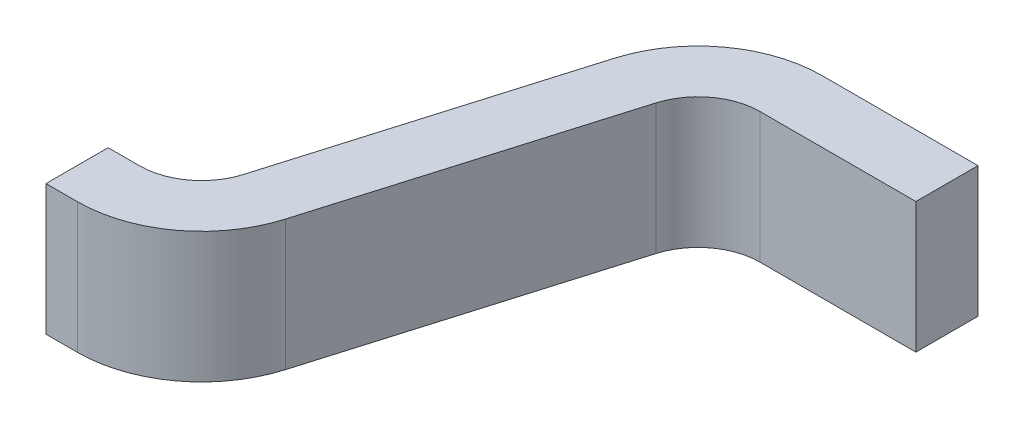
ISO-10303-21;
HEADER;
FILE_DESCRIPTION(('STEP AP214'),'2;1');
FILE_NAME('part.step','',(''),(''),'','','');
FILE_SCHEMA(('AUTOMOTIVE_DESIGN { 1 0 10303 214 1 1 1 1 }'));
ENDSEC;
DATA;
#1=APPLICATION_CONTEXT('core data for automotive mechanical design processes');
#2=APPLICATION_PROTOCOL_DEFINITION('international standard','automotive_design',2000,#1);
#3=PRODUCT_CONTEXT('',#1,'mechanical');
#4=PRODUCT('Part','Part','',(#3));
#5=PRODUCT_RELATED_PRODUCT_CATEGORY('part','',(#4));
#6=PRODUCT_DEFINITION_FORMATION('','',#4);
#7=PRODUCT_DEFINITION_CONTEXT('part definition',#1,'design');
#8=PRODUCT_DEFINITION('design','',#6,#7);
#9=PRODUCT_DEFINITION_SHAPE('','',#8);
#10=(LENGTH_UNIT() NAMED_UNIT(*) SI_UNIT(.MILLI.,.METRE.));
#11=(NAMED_UNIT(*) PLANE_ANGLE_UNIT() SI_UNIT($,.RADIAN.));
#12=(NAMED_UNIT(*) SI_UNIT($,.STERADIAN.) SOLID_ANGLE_UNIT());
#13=UNCERTAINTY_MEASURE_WITH_UNIT(LENGTH_MEASURE(1.E-05),#10,'distance_accuracy_value','');
#14=(GEOMETRIC_REPRESENTATION_CONTEXT(3) GLOBAL_UNCERTAINTY_ASSIGNED_CONTEXT((#13)) GLOBAL_UNIT_ASSIGNED_CONTEXT((#10,
#11,#12)) REPRESENTATION_CONTEXT('',''));
#15=CARTESIAN_POINT('',(0.,0.,0.));
#16=DIRECTION('',(0.,0.,1.));
#17=DIRECTION('',(1.,0.,0.));
#18=AXIS2_PLACEMENT_3D('',#15,#16,#17);
#19=CARTESIAN_POINT('',(4.4000000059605,-1.6950000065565,0.));
#20=DIRECTION('',(0.,-1.,0.));
#21=DIRECTION('',(1.,0.,0.));
#22=AXIS2_PLACEMENT_3D('',#19,#20,#21);
#23=PLANE('',#22);
#24=CARTESIAN_POINT('',(4.69869430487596,-1.6950000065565,0.40000000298));
#25=DIRECTION('',(0.,1.,0.));
#26=DIRECTION('',(-1.,0.,0.));
#27=AXIS2_PLACEMENT_3D('',#24,#25,#26);
#28=CIRCLE('',#27,0.2);
#29=CARTESIAN_POINT('',(4.50693033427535,-1.6950000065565,0.343197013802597));
#30=VERTEX_POINT('',#29);
#31=CARTESIAN_POINT('',(4.69869430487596,-1.6950000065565,0.20000000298));
#32=VERTEX_POINT('',#31);
#33=EDGE_CURVE('E189',#30,#32,#28,.F.);
#34=ORIENTED_EDGE('',*,*,#33,.T.);
#35=DIRECTION('',(1.,0.,0.));
#36=VECTOR('',#35,1.);
#37=CARTESIAN_POINT('',(5.2000000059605,-1.6950000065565,0.20000000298));
#38=LINE('',#37,#36);
#39=CARTESIAN_POINT('',(5.2000000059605,-1.6950000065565,0.20000000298));
#40=VERTEX_POINT('',#39);
#41=EDGE_CURVE('E148',#40,#32,#38,.F.);
#42=ORIENTED_EDGE('',*,*,#41,.F.);
#43=DIRECTION('',(0.,0.,1.));
#44=VECTOR('',#43,1.);
#45=CARTESIAN_POINT('',(5.2000000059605,-1.6950000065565,0.));
#46=LINE('',#45,#44);
#47=CARTESIAN_POINT('',(5.2000000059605,-1.6950000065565,0.));
#48=VERTEX_POINT('',#47);
#49=EDGE_CURVE('E154',#40,#48,#46,.F.);
#50=ORIENTED_EDGE('',*,*,#49,.T.);
#51=DIRECTION('',(1.,0.,0.));
#52=VECTOR('',#51,1.);
#53=CARTESIAN_POINT('',(5.2000000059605,-1.6950000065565,0.));
#54=LINE('',#53,#52);
#55=CARTESIAN_POINT('',(4.69869430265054,-1.6950000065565,0.));
#56=VERTEX_POINT('',#55);
#57=EDGE_CURVE('E158',#48,#56,#54,.F.);
#58=ORIENTED_EDGE('',*,*,#57,.T.);
#59=CARTESIAN_POINT('',(4.69869430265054,-1.6950000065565,0.4));
#60=DIRECTION('',(0.,-1.,0.));
#61=DIRECTION('',(1.,0.,0.));
#62=AXIS2_PLACEMENT_3D('',#59,#60,#61);
#63=CIRCLE('',#62,0.4);
#64=CARTESIAN_POINT('',(4.31516636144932,-1.6950000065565,0.286394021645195));
#65=VERTEX_POINT('',#64);
#66=EDGE_CURVE('E168',#65,#56,#63,.T.);
#67=ORIENTED_EDGE('',*,*,#66,.F.);
#68=DIRECTION('',(0.284014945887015,0.,-0.958819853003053));
#69=VECTOR('',#68,1.);
#70=CARTESIAN_POINT('',(4.4000000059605,-1.6950000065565,0.));
#71=LINE('',#70,#69);
#72=CARTESIAN_POINT('',(4.04252922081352,-1.6950000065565,1.2068029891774));
#73=VERTEX_POINT('',#72);
#74=EDGE_CURVE('E166',#65,#73,#71,.F.);
#75=ORIENTED_EDGE('',*,*,#74,.T.);
#76=CARTESIAN_POINT('',(3.85076525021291,-1.6950000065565,1.15));
#77=DIRECTION('',(0.,-1.,0.));
#78=DIRECTION('',(1.,0.,0.));
#79=AXIS2_PLACEMENT_3D('',#76,#77,#78);
#80=CIRCLE('',#79,0.2);
#81=CARTESIAN_POINT('',(3.85076525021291,-1.6950000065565,1.35));
#82=VERTEX_POINT('',#81);
#83=EDGE_CURVE('E20',#73,#82,#80,.T.);
#84=ORIENTED_EDGE('',*,*,#83,.T.);
#85=DIRECTION('',(1.,0.,0.));
#86=VECTOR('',#85,1.);
#87=CARTESIAN_POINT('',(4.1500000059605,-1.6950000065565,1.35));
#88=LINE('',#87,#86);
#89=CARTESIAN_POINT('',(3.7500000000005,-1.6950000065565,1.35));
#90=VERTEX_POINT('',#89);
#91=EDGE_CURVE('E96',#82,#90,#88,.F.);
#92=ORIENTED_EDGE('',*,*,#91,.T.);
#93=DIRECTION('',(0.,0.,1.));
#94=VECTOR('',#93,1.);
#95=CARTESIAN_POINT('',(3.7500000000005,-1.6950000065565,1.35));
#96=LINE('',#95,#94);
#97=CARTESIAN_POINT('',(3.7500000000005,-1.6950000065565,1.55000000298));
#98=VERTEX_POINT('',#97);
#99=EDGE_CURVE('E115',#98,#90,#96,.F.);
#100=ORIENTED_EDGE('',*,*,#99,.F.);
#101=DIRECTION('',(1.,0.,0.));
#102=VECTOR('',#101,1.);
#103=CARTESIAN_POINT('',(4.1500000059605,-1.6950000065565,1.55000000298));
#104=LINE('',#103,#102);
#105=CARTESIAN_POINT('',(3.85076525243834,-1.6950000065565,1.55000000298));
#106=VERTEX_POINT('',#105);
#107=EDGE_CURVE('E138',#106,#98,#104,.F.);
#108=ORIENTED_EDGE('',*,*,#107,.F.);
#109=CARTESIAN_POINT('',(3.85076525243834,-1.6950000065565,1.15000000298));
#110=DIRECTION('',(0.,-1.,0.));
#111=DIRECTION('',(1.,0.,0.));
#112=AXIS2_PLACEMENT_3D('',#109,#110,#111);
#113=CIRCLE('',#112,0.4);
#114=CARTESIAN_POINT('',(4.23429319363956,-1.6950000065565,1.2636059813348));
#115=VERTEX_POINT('',#114);
#116=EDGE_CURVE('E143',#115,#106,#113,.T.);
#117=ORIENTED_EDGE('',*,*,#116,.F.);
#118=DIRECTION('',(0.284014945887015,0.,-0.958819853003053));
#119=VECTOR('',#118,1.);
#120=CARTESIAN_POINT('',(4.5917639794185,-1.6950000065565,0.0568029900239));
#121=LINE('',#120,#119);
#122=EDGE_CURVE('E141',#30,#115,#121,.F.);
#123=ORIENTED_EDGE('',*,*,#122,.F.);
#124=EDGE_LOOP('',(#34,#42,#50,#58,#67,#75,#84,#92,#100,#108,#117,#123));
#125=FACE_BOUND('',#124,.T.);
#126=ADVANCED_FACE('F17',(#125),#23,.F.);
#127=CARTESIAN_POINT('',(4.1500000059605,-1.6950000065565,1.55000000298));
#128=DIRECTION('',(0.,0.,1.));
#129=DIRECTION('',(1.,0.,0.));
#130=AXIS2_PLACEMENT_3D('',#127,#128,#129);
#131=PLANE('',#130);
#132=DIRECTION('',(1.,0.,0.));
#133=VECTOR('',#132,1.);
#134=CARTESIAN_POINT('',(4.4000000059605,-2.1149999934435,1.55000000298));
#135=LINE('',#134,#133);
#136=CARTESIAN_POINT('',(3.85076525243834,-2.1149999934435,1.55000000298));
#137=VERTEX_POINT('',#136);
#138=CARTESIAN_POINT('',(3.7500000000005,-2.1149999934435,1.55000000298));
#139=VERTEX_POINT('',#138);
#140=EDGE_CURVE('E129',#137,#139,#135,.F.);
#141=ORIENTED_EDGE('',*,*,#140,.F.);
#142=DIRECTION('',(0.,-1.,0.));
#143=VECTOR('',#142,1.);
#144=CARTESIAN_POINT('',(3.85076525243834,-1.6950000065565,1.55000000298));
#145=LINE('',#144,#143);
#146=EDGE_CURVE('E188',#106,#137,#145,.T.);
#147=ORIENTED_EDGE('',*,*,#146,.F.);
#148=ORIENTED_EDGE('',*,*,#107,.T.);
#149=DIRECTION('',(0.,-1.,0.));
#150=VECTOR('',#149,1.);
#151=CARTESIAN_POINT('',(3.7500000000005,-1.6950000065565,1.55000000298));
#152=LINE('',#151,#150);
#153=EDGE_CURVE('E104',#139,#98,#152,.F.);
#154=ORIENTED_EDGE('',*,*,#153,.F.);
#155=EDGE_LOOP('',(#141,#147,#148,#154));
#156=FACE_BOUND('',#155,.T.);
#157=ADVANCED_FACE('F262',(#156),#131,.T.);
#158=CARTESIAN_POINT('',(3.7500000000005,-1.6950000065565,1.35));
#159=DIRECTION('',(-1.,0.,0.));
#160=DIRECTION('',(0.,-1.,0.));
#161=AXIS2_PLACEMENT_3D('',#158,#159,#160);
#162=PLANE('',#161);
#163=DIRECTION('',(0.,1.,0.));
#164=VECTOR('',#163,1.);
#165=CARTESIAN_POINT('',(3.7500000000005,-1.6950000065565,1.35));
#166=LINE('',#165,#164);
#167=CARTESIAN_POINT('',(3.7500000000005,-2.1149999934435,1.35));
#168=VERTEX_POINT('',#167);
#169=EDGE_CURVE('E109',#90,#168,#166,.F.);
#170=ORIENTED_EDGE('',*,*,#169,.T.);
#171=DIRECTION('',(0.,0.,1.));
#172=VECTOR('',#171,1.);
#173=CARTESIAN_POINT('',(3.7500000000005,-2.1149999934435,0.));
#174=LINE('',#173,#172);
#175=EDGE_CURVE('E113',#139,#168,#174,.F.);
#176=ORIENTED_EDGE('',*,*,#175,.F.);
#177=ORIENTED_EDGE('',*,*,#153,.T.);
#178=ORIENTED_EDGE('',*,*,#99,.T.);
#179=EDGE_LOOP('',(#170,#176,#177,#178));
#180=FACE_BOUND('',#179,.T.);
#181=ADVANCED_FACE('F111',(#180),#162,.T.);
#182=CARTESIAN_POINT('',(4.1500000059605,-1.6950000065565,1.35));
#183=DIRECTION('',(0.,0.,1.));
#184=DIRECTION('',(1.,0.,0.));
#185=AXIS2_PLACEMENT_3D('',#182,#183,#184);
#186=PLANE('',#185);
#187=ORIENTED_EDGE('',*,*,#169,.F.);
#188=ORIENTED_EDGE('',*,*,#91,.F.);
#189=DIRECTION('',(0.,-1.,0.));
#190=VECTOR('',#189,1.);
#191=CARTESIAN_POINT('',(3.85076525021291,-1.6950000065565,1.35));
#192=LINE('',#191,#190);
#193=CARTESIAN_POINT('',(3.85076525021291,-2.1149999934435,1.35));
#194=VERTEX_POINT('',#193);
#195=EDGE_CURVE('E121',#82,#194,#192,.T.);
#196=ORIENTED_EDGE('',*,*,#195,.T.);
#197=DIRECTION('',(1.,0.,0.));
#198=VECTOR('',#197,1.);
#199=CARTESIAN_POINT('',(4.4000000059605,-2.1149999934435,1.35));
#200=LINE('',#199,#198);
#201=EDGE_CURVE('E119',#168,#194,#200,.T.);
#202=ORIENTED_EDGE('',*,*,#201,.F.);
#203=EDGE_LOOP('',(#187,#188,#196,#202));
#204=FACE_BOUND('',#203,.T.);
#205=ADVANCED_FACE('F120',(#204),#186,.F.);
#206=CARTESIAN_POINT('',(3.85076525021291,-1.6950000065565,1.15));
#207=DIRECTION('',(0.,-1.,0.));
#208=DIRECTION('',(1.,0.,0.));
#209=AXIS2_PLACEMENT_3D('',#206,#207,#208);
#210=CYLINDRICAL_SURFACE('',#209,0.2);
#211=ORIENTED_EDGE('',*,*,#195,.F.);
#212=ORIENTED_EDGE('',*,*,#83,.F.);
#213=DIRECTION('',(0.,1.,0.));
#214=VECTOR('',#213,1.);
#215=CARTESIAN_POINT('',(4.04252922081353,-1.6950000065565,1.2068029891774));
#216=LINE('',#215,#214);
#217=CARTESIAN_POINT('',(4.04252922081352,-2.1149999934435,1.2068029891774));
#218=VERTEX_POINT('',#217);
#219=EDGE_CURVE('E169',#73,#218,#216,.F.);
#220=ORIENTED_EDGE('',*,*,#219,.T.);
#221=CARTESIAN_POINT('',(3.85076525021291,-2.1149999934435,1.15));
#222=DIRECTION('',(0.,-1.,0.));
#223=DIRECTION('',(1.,0.,0.));
#224=AXIS2_PLACEMENT_3D('',#221,#222,#223);
#225=CIRCLE('',#224,0.2);
#226=EDGE_CURVE('E125',#194,#218,#225,.F.);
#227=ORIENTED_EDGE('',*,*,#226,.F.);
#228=EDGE_LOOP('',(#211,#212,#220,#227));
#229=FACE_BOUND('',#228,.T.);
#230=ADVANCED_FACE('F202',(#229),#210,.F.);
#231=CARTESIAN_POINT('',(4.4000000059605,-1.6950000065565,0.));
#232=DIRECTION('',(0.958819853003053,0.,0.284014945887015));
#233=DIRECTION('',(0.284014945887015,0.,-0.958819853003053));
#234=AXIS2_PLACEMENT_3D('',#231,#232,#233);
#235=PLANE('',#234);
#236=DIRECTION('',(0.,-1.,0.));
#237=VECTOR('',#236,1.);
#238=CARTESIAN_POINT('',(4.31516636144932,-1.6950000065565,0.286394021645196));
#239=LINE('',#238,#237);
#240=CARTESIAN_POINT('',(4.31516636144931,-2.1149999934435,0.286394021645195));
#241=VERTEX_POINT('',#240);
#242=EDGE_CURVE('E191',#241,#65,#239,.F.);
#243=ORIENTED_EDGE('',*,*,#242,.F.);
#244=DIRECTION('',(0.284014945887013,0.,-0.958819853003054));
#245=VECTOR('',#244,1.);
#246=CARTESIAN_POINT('',(4.04252922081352,-2.1149999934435,1.2068029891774));
#247=LINE('',#246,#245);
#248=EDGE_CURVE('E184',#218,#241,#247,.T.);
#249=ORIENTED_EDGE('',*,*,#248,.F.);
#250=ORIENTED_EDGE('',*,*,#219,.F.);
#251=ORIENTED_EDGE('',*,*,#74,.F.);
#252=EDGE_LOOP('',(#243,#249,#250,#251));
#253=FACE_BOUND('',#252,.T.);
#254=ADVANCED_FACE('F206',(#253),#235,.F.);
#255=CARTESIAN_POINT('',(4.69869430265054,-1.6950000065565,0.4));
#256=DIRECTION('',(0.,-1.,0.));
#257=DIRECTION('',(1.,0.,0.));
#258=AXIS2_PLACEMENT_3D('',#255,#256,#257);
#259=CYLINDRICAL_SURFACE('',#258,0.4);
#260=CARTESIAN_POINT('',(4.69869430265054,-2.1149999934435,0.4));
#261=DIRECTION('',(0.,-1.,0.));
#262=DIRECTION('',(1.,0.,0.));
#263=AXIS2_PLACEMENT_3D('',#260,#261,#262);
#264=CIRCLE('',#263,0.4);
#265=CARTESIAN_POINT('',(4.69869430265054,-2.1149999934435,0.));
#266=VERTEX_POINT('',#265);
#267=EDGE_CURVE('E180',#241,#266,#264,.T.);
#268=ORIENTED_EDGE('',*,*,#267,.F.);
#269=ORIENTED_EDGE('',*,*,#242,.T.);
#270=ORIENTED_EDGE('',*,*,#66,.T.);
#271=DIRECTION('',(0.,1.,0.));
#272=VECTOR('',#271,1.);
#273=CARTESIAN_POINT('',(4.69869430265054,-1.6950000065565,0.));
#274=LINE('',#273,#272);
#275=EDGE_CURVE('E163',#56,#266,#274,.F.);
#276=ORIENTED_EDGE('',*,*,#275,.T.);
#277=EDGE_LOOP('',(#268,#269,#270,#276));
#278=FACE_BOUND('',#277,.T.);
#279=ADVANCED_FACE('F289',(#278),#259,.T.);
#280=CARTESIAN_POINT('',(5.2000000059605,-1.6950000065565,0.));
#281=DIRECTION('',(0.,0.,1.));
#282=DIRECTION('',(1.,0.,0.));
#283=AXIS2_PLACEMENT_3D('',#280,#281,#282);
#284=PLANE('',#283);
#285=DIRECTION('',(0.,-1.,0.));
#286=VECTOR('',#285,1.);
#287=CARTESIAN_POINT('',(5.2000000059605,-1.6950000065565,0.));
#288=LINE('',#287,#286);
#289=CARTESIAN_POINT('',(5.2000000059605,-2.1149999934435,0.));
#290=VERTEX_POINT('',#289);
#291=EDGE_CURVE('E157',#48,#290,#288,.T.);
#292=ORIENTED_EDGE('',*,*,#291,.T.);
#293=DIRECTION('',(1.,0.,0.));
#294=VECTOR('',#293,1.);
#295=CARTESIAN_POINT('',(4.4000000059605,-2.1149999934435,0.));
#296=LINE('',#295,#294);
#297=EDGE_CURVE('E183',#266,#290,#296,.T.);
#298=ORIENTED_EDGE('',*,*,#297,.F.);
#299=ORIENTED_EDGE('',*,*,#275,.F.);
#300=ORIENTED_EDGE('',*,*,#57,.F.);
#301=EDGE_LOOP('',(#292,#298,#299,#300));
#302=FACE_BOUND('',#301,.T.);
#303=ADVANCED_FACE('F238',(#302),#284,.F.);
#304=CARTESIAN_POINT('',(5.2000000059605,-1.6950000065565,0.));
#305=DIRECTION('',(-1.,0.,0.));
#306=DIRECTION('',(0.,-1.,0.));
#307=AXIS2_PLACEMENT_3D('',#304,#305,#306);
#308=PLANE('',#307);
#309=DIRECTION('',(0.,0.,1.));
#310=VECTOR('',#309,1.);
#311=CARTESIAN_POINT('',(5.2000000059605,-2.1149999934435,0.));
#312=LINE('',#311,#310);
#313=CARTESIAN_POINT('',(5.2000000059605,-2.1149999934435,0.20000000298));
#314=VERTEX_POINT('',#313);
#315=EDGE_CURVE('E226',#290,#314,#312,.T.);
#316=ORIENTED_EDGE('',*,*,#315,.F.);
#317=ORIENTED_EDGE('',*,*,#291,.F.);
#318=ORIENTED_EDGE('',*,*,#49,.F.);
#319=DIRECTION('',(0.,1.,0.));
#320=VECTOR('',#319,1.);
#321=CARTESIAN_POINT('',(5.2000000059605,-1.6950000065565,0.20000000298));
#322=LINE('',#321,#320);
#323=EDGE_CURVE('E151',#314,#40,#322,.T.);
#324=ORIENTED_EDGE('',*,*,#323,.F.);
#325=EDGE_LOOP('',(#316,#317,#318,#324));
#326=FACE_BOUND('',#325,.T.);
#327=ADVANCED_FACE('F245',(#326),#308,.F.);
#328=CARTESIAN_POINT('',(5.2000000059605,-1.6950000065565,0.20000000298));
#329=DIRECTION('',(0.,0.,1.));
#330=DIRECTION('',(1.,0.,0.));
#331=AXIS2_PLACEMENT_3D('',#328,#329,#330);
#332=PLANE('',#331);
#333=ORIENTED_EDGE('',*,*,#41,.T.);
#334=DIRECTION('',(0.,1.,0.));
#335=VECTOR('',#334,1.);
#336=CARTESIAN_POINT('',(4.69869430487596,-1.6950000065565,0.20000000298));
#337=LINE('',#336,#335);
#338=CARTESIAN_POINT('',(4.69869430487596,-2.1149999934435,0.20000000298));
#339=VERTEX_POINT('',#338);
#340=EDGE_CURVE('E150',#32,#339,#337,.F.);
#341=ORIENTED_EDGE('',*,*,#340,.T.);
#342=DIRECTION('',(1.,0.,0.));
#343=VECTOR('',#342,1.);
#344=CARTESIAN_POINT('',(4.4000000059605,-2.1149999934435,0.20000000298));
#345=LINE('',#344,#343);
#346=EDGE_CURVE('E179',#314,#339,#345,.F.);
#347=ORIENTED_EDGE('',*,*,#346,.F.);
#348=ORIENTED_EDGE('',*,*,#323,.T.);
#349=EDGE_LOOP('',(#333,#341,#347,#348));
#350=FACE_BOUND('',#349,.T.);
#351=ADVANCED_FACE('F281',(#350),#332,.T.);
#352=CARTESIAN_POINT('',(4.69869430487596,-1.6950000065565,0.40000000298));
#353=DIRECTION('',(0.,1.,0.));
#354=DIRECTION('',(-1.,0.,0.));
#355=AXIS2_PLACEMENT_3D('',#352,#353,#354);
#356=CYLINDRICAL_SURFACE('',#355,0.2);
#357=DIRECTION('',(0.,1.,0.));
#358=VECTOR('',#357,1.);
#359=CARTESIAN_POINT('',(4.50693033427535,-1.6950000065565,0.343197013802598));
#360=LINE('',#359,#358);
#361=CARTESIAN_POINT('',(4.50693033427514,-2.1149999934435,0.343197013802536));
#362=VERTEX_POINT('',#361);
#363=EDGE_CURVE('E144',#362,#30,#360,.T.);
#364=ORIENTED_EDGE('',*,*,#363,.F.);
#365=CARTESIAN_POINT('',(4.69869430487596,-2.1149999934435,0.40000000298));
#366=DIRECTION('',(0.,1.,0.));
#367=DIRECTION('',(-1.,0.,0.));
#368=AXIS2_PLACEMENT_3D('',#365,#366,#367);
#369=CIRCLE('',#368,0.2);
#370=EDGE_CURVE('E176',#339,#362,#369,.T.);
#371=ORIENTED_EDGE('',*,*,#370,.F.);
#372=ORIENTED_EDGE('',*,*,#340,.F.);
#373=ORIENTED_EDGE('',*,*,#33,.F.);
#374=EDGE_LOOP('',(#364,#371,#372,#373));
#375=FACE_BOUND('',#374,.T.);
#376=ADVANCED_FACE('F256',(#375),#356,.F.);
#377=CARTESIAN_POINT('',(4.5917639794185,-1.6950000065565,0.0568029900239));
#378=DIRECTION('',(0.958819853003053,0.,0.284014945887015));
#379=DIRECTION('',(0.284014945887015,0.,-0.958819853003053));
#380=AXIS2_PLACEMENT_3D('',#377,#378,#379);
#381=PLANE('',#380);
#382=ORIENTED_EDGE('',*,*,#122,.T.);
#383=DIRECTION('',(0.,-1.,0.));
#384=VECTOR('',#383,1.);
#385=CARTESIAN_POINT('',(4.23429319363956,-1.6950000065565,1.2636059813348));
#386=LINE('',#385,#384);
#387=CARTESIAN_POINT('',(4.23429319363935,-2.1149999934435,1.26360598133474));
#388=VERTEX_POINT('',#387);
#389=EDGE_CURVE('E35',#388,#115,#386,.F.);
#390=ORIENTED_EDGE('',*,*,#389,.F.);
#391=DIRECTION('',(-0.284014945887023,0.,0.95881985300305));
#392=VECTOR('',#391,1.);
#393=CARTESIAN_POINT('',(4.50693033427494,-2.1149999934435,0.343197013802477));
#394=LINE('',#393,#392);
#395=EDGE_CURVE('E26',#362,#388,#394,.T.);
#396=ORIENTED_EDGE('',*,*,#395,.F.);
#397=ORIENTED_EDGE('',*,*,#363,.T.);
#398=EDGE_LOOP('',(#382,#390,#396,#397));
#399=FACE_BOUND('',#398,.T.);
#400=ADVANCED_FACE('F253',(#399),#381,.T.);
#401=CARTESIAN_POINT('',(3.85076525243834,-1.6950000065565,1.15000000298));
#402=DIRECTION('',(0.,-1.,0.));
#403=DIRECTION('',(1.,0.,0.));
#404=AXIS2_PLACEMENT_3D('',#401,#402,#403);
#405=CYLINDRICAL_SURFACE('',#404,0.4);
#406=CARTESIAN_POINT('',(3.85076525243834,-2.1149999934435,1.15000000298));
#407=DIRECTION('',(0.,-1.,0.));
#408=DIRECTION('',(1.,0.,0.));
#409=AXIS2_PLACEMENT_3D('',#406,#407,#408);
#410=CIRCLE('',#409,0.4);
#411=EDGE_CURVE('E11',#388,#137,#410,.T.);
#412=ORIENTED_EDGE('',*,*,#411,.F.);
#413=ORIENTED_EDGE('',*,*,#389,.T.);
#414=ORIENTED_EDGE('',*,*,#116,.T.);
#415=ORIENTED_EDGE('',*,*,#146,.T.);
#416=EDGE_LOOP('',(#412,#413,#414,#415));
#417=FACE_BOUND('',#416,.T.);
#418=ADVANCED_FACE('F261',(#417),#405,.T.);
#419=CARTESIAN_POINT('',(4.4000000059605,-2.1149999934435,0.));
#420=DIRECTION('',(0.,-1.,0.));
#421=DIRECTION('',(1.,0.,0.));
#422=AXIS2_PLACEMENT_3D('',#419,#420,#421);
#423=PLANE('',#422);
#424=ORIENTED_EDGE('',*,*,#395,.T.);
#425=ORIENTED_EDGE('',*,*,#411,.T.);
#426=ORIENTED_EDGE('',*,*,#140,.T.);
#427=ORIENTED_EDGE('',*,*,#175,.T.);
#428=ORIENTED_EDGE('',*,*,#201,.T.);
#429=ORIENTED_EDGE('',*,*,#226,.T.);
#430=ORIENTED_EDGE('',*,*,#248,.T.);
#431=ORIENTED_EDGE('',*,*,#267,.T.);
#432=ORIENTED_EDGE('',*,*,#297,.T.);
#433=ORIENTED_EDGE('',*,*,#315,.T.);
#434=ORIENTED_EDGE('',*,*,#346,.T.);
#435=ORIENTED_EDGE('',*,*,#370,.T.);
#436=EDGE_LOOP('',(#424,#425,#426,#427,#428,#429,#430,#431,#432,#433,#434,#435));
#437=FACE_BOUND('',#436,.T.);
#438=ADVANCED_FACE('F128',(#437),#423,.T.);
#439=CLOSED_SHELL('',(#126,#157,#181,#205,#230,#254,#279,#303,#327,#351,#376,#400,#418,#438));
#440=MANIFOLD_SOLID_BREP('B1',#439);
#441=ADVANCED_BREP_SHAPE_REPRESENTATION('',(#18,#440),#14);
#442=SHAPE_DEFINITION_REPRESENTATION(#9,#441);
ENDSEC;
END-ISO-10303-21;
